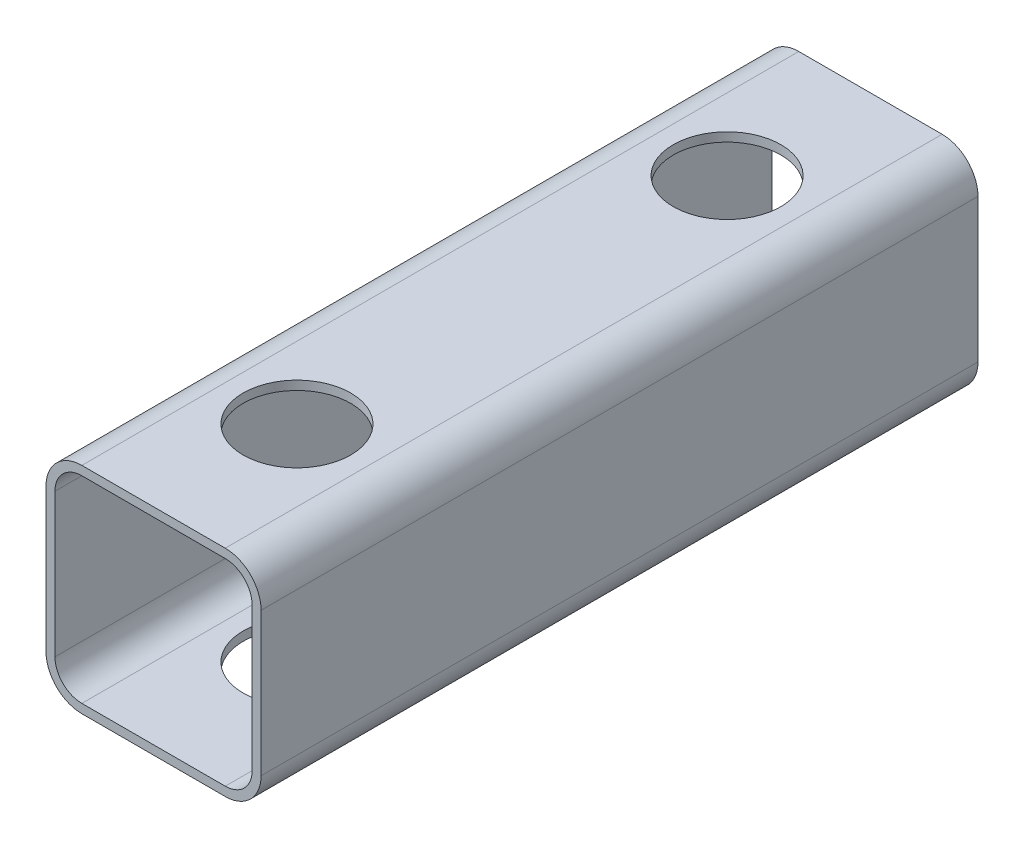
ISO-10303-21;
HEADER;
FILE_DESCRIPTION(('STEP AP214'),'2;1');
FILE_NAME('part.step','',(''),(''),'','','');
FILE_SCHEMA(('AUTOMOTIVE_DESIGN { 1 0 10303 214 1 1 1 1 }'));
ENDSEC;
DATA;
#1=APPLICATION_CONTEXT('core data for automotive mechanical design processes');
#2=APPLICATION_PROTOCOL_DEFINITION('international standard','automotive_design',2000,#1);
#3=PRODUCT_CONTEXT('',#1,'mechanical');
#4=PRODUCT('Part','Part','',(#3));
#5=PRODUCT_RELATED_PRODUCT_CATEGORY('part','',(#4));
#6=PRODUCT_DEFINITION_FORMATION('','',#4);
#7=PRODUCT_DEFINITION_CONTEXT('part definition',#1,'design');
#8=PRODUCT_DEFINITION('design','',#6,#7);
#9=PRODUCT_DEFINITION_SHAPE('','',#8);
#10=(LENGTH_UNIT() NAMED_UNIT(*) SI_UNIT(.MILLI.,.METRE.));
#11=(NAMED_UNIT(*) PLANE_ANGLE_UNIT() SI_UNIT($,.RADIAN.));
#12=(NAMED_UNIT(*) SI_UNIT($,.STERADIAN.) SOLID_ANGLE_UNIT());
#13=UNCERTAINTY_MEASURE_WITH_UNIT(LENGTH_MEASURE(1.E-05),#10,'distance_accuracy_value','');
#14=(GEOMETRIC_REPRESENTATION_CONTEXT(3) GLOBAL_UNCERTAINTY_ASSIGNED_CONTEXT((#13)) GLOBAL_UNIT_ASSIGNED_CONTEXT((#10,
#11,#12)) REPRESENTATION_CONTEXT('',''));
#15=CARTESIAN_POINT('',(0.,0.,0.));
#16=DIRECTION('',(0.,0.,1.));
#17=DIRECTION('',(1.,0.,0.));
#18=AXIS2_PLACEMENT_3D('',#15,#16,#17);
#19=CARTESIAN_POINT('',(-25.4,38.1,254.));
#20=DIRECTION('',(0.,1.,0.));
#21=DIRECTION('',(-1.,0.,0.));
#22=AXIS2_PLACEMENT_3D('',#19,#20,#21);
#23=PLANE('',#22);
#24=DIRECTION('',(1.,0.,0.));
#25=VECTOR('',#24,1.);
#26=CARTESIAN_POINT('',(-25.4,38.1,0.));
#27=LINE('',#26,#25);
#28=CARTESIAN_POINT('',(-25.4,38.1,0.));
#29=VERTEX_POINT('',#28);
#30=CARTESIAN_POINT('',(25.4,38.1,0.));
#31=VERTEX_POINT('',#30);
#32=EDGE_CURVE('E243',#29,#31,#27,.T.);
#33=ORIENTED_EDGE('',*,*,#32,.F.);
#34=DIRECTION('',(0.,0.,-1.));
#35=VECTOR('',#34,1.);
#36=CARTESIAN_POINT('',(-25.4,38.1,254.));
#37=LINE('',#36,#35);
#38=CARTESIAN_POINT('',(-25.4,38.1,254.));
#39=VERTEX_POINT('',#38);
#40=EDGE_CURVE('E41',#39,#29,#37,.T.);
#41=ORIENTED_EDGE('',*,*,#40,.F.);
#42=DIRECTION('',(1.,0.,0.));
#43=VECTOR('',#42,1.);
#44=CARTESIAN_POINT('',(-25.4,38.1,254.));
#45=LINE('',#44,#43);
#46=CARTESIAN_POINT('',(25.4,38.1,254.));
#47=VERTEX_POINT('',#46);
#48=EDGE_CURVE('E220',#39,#47,#45,.T.);
#49=ORIENTED_EDGE('',*,*,#48,.T.);
#50=DIRECTION('',(0.,0.,-1.));
#51=VECTOR('',#50,1.);
#52=CARTESIAN_POINT('',(25.4,38.1,254.));
#53=LINE('',#52,#51);
#54=EDGE_CURVE('E11',#47,#31,#53,.T.);
#55=ORIENTED_EDGE('',*,*,#54,.T.);
#56=EDGE_LOOP('',(#33,#41,#49,#55));
#57=FACE_BOUND('',#56,.T.);
#58=CARTESIAN_POINT('',(0.,38.1,50.8));
#59=DIRECTION('',(0.,1.,0.));
#60=DIRECTION('',(-1.,0.,0.));
#61=AXIS2_PLACEMENT_3D('',#58,#59,#60);
#62=CIRCLE('',#61,19.05);
#63=CARTESIAN_POINT('',(-19.05,38.1,50.8));
#64=VERTEX_POINT('',#63);
#65=EDGE_CURVE('E281',#64,#64,#62,.T.);
#66=ORIENTED_EDGE('',*,*,#65,.F.);
#67=EDGE_LOOP('',(#66));
#68=FACE_BOUND('',#67,.T.);
#69=CARTESIAN_POINT('',(0.,38.1,203.2));
#70=DIRECTION('',(0.,-1.,0.));
#71=DIRECTION('',(1.,0.,0.));
#72=AXIS2_PLACEMENT_3D('',#69,#70,#71);
#73=CIRCLE('',#72,19.05);
#74=CARTESIAN_POINT('',(19.05,38.1,203.2));
#75=VERTEX_POINT('',#74);
#76=EDGE_CURVE('E291',#75,#75,#73,.T.);
#77=ORIENTED_EDGE('',*,*,#76,.T.);
#78=EDGE_LOOP('',(#77));
#79=FACE_BOUND('',#78,.T.);
#80=ADVANCED_FACE('F32',(#57,#68,#79),#23,.T.);
#81=CARTESIAN_POINT('',(25.4,-38.1,254.));
#82=DIRECTION('',(0.,-1.,0.));
#83=DIRECTION('',(1.,0.,0.));
#84=AXIS2_PLACEMENT_3D('',#81,#82,#83);
#85=PLANE('',#84);
#86=DIRECTION('',(-1.,0.,0.));
#87=VECTOR('',#86,1.);
#88=CARTESIAN_POINT('',(25.4,-38.1,0.));
#89=LINE('',#88,#87);
#90=CARTESIAN_POINT('',(25.4,-38.1,0.));
#91=VERTEX_POINT('',#90);
#92=CARTESIAN_POINT('',(-25.4,-38.1,0.));
#93=VERTEX_POINT('',#92);
#94=EDGE_CURVE('E255',#91,#93,#89,.T.);
#95=ORIENTED_EDGE('',*,*,#94,.F.);
#96=DIRECTION('',(0.,0.,-1.));
#97=VECTOR('',#96,1.);
#98=CARTESIAN_POINT('',(25.4,-38.1,254.));
#99=LINE('',#98,#97);
#100=CARTESIAN_POINT('',(25.4,-38.1,254.));
#101=VERTEX_POINT('',#100);
#102=EDGE_CURVE('E266',#101,#91,#99,.T.);
#103=ORIENTED_EDGE('',*,*,#102,.F.);
#104=DIRECTION('',(-1.,0.,0.));
#105=VECTOR('',#104,1.);
#106=CARTESIAN_POINT('',(25.4,-38.1,254.));
#107=LINE('',#106,#105);
#108=CARTESIAN_POINT('',(-25.4,-38.1,254.));
#109=VERTEX_POINT('',#108);
#110=EDGE_CURVE('E232',#101,#109,#107,.T.);
#111=ORIENTED_EDGE('',*,*,#110,.T.);
#112=DIRECTION('',(0.,0.,-1.));
#113=VECTOR('',#112,1.);
#114=CARTESIAN_POINT('',(-25.4,-38.1,254.));
#115=LINE('',#114,#113);
#116=EDGE_CURVE('E268',#109,#93,#115,.T.);
#117=ORIENTED_EDGE('',*,*,#116,.T.);
#118=EDGE_LOOP('',(#95,#103,#111,#117));
#119=FACE_BOUND('',#118,.T.);
#120=CARTESIAN_POINT('',(0.,-38.1,50.8));
#121=DIRECTION('',(0.,1.,0.));
#122=DIRECTION('',(-1.,0.,0.));
#123=AXIS2_PLACEMENT_3D('',#120,#121,#122);
#124=CIRCLE('',#123,19.05);
#125=CARTESIAN_POINT('',(-19.05,-38.1,50.8));
#126=VERTEX_POINT('',#125);
#127=EDGE_CURVE('E276',#126,#126,#124,.T.);
#128=ORIENTED_EDGE('',*,*,#127,.T.);
#129=EDGE_LOOP('',(#128));
#130=FACE_BOUND('',#129,.T.);
#131=CARTESIAN_POINT('',(0.,-38.1,203.2));
#132=DIRECTION('',(0.,-1.,0.));
#133=DIRECTION('',(1.,0.,0.));
#134=AXIS2_PLACEMENT_3D('',#131,#132,#133);
#135=CIRCLE('',#134,19.05);
#136=CARTESIAN_POINT('',(19.05,-38.1,203.2));
#137=VERTEX_POINT('',#136);
#138=EDGE_CURVE('E294',#137,#137,#135,.T.);
#139=ORIENTED_EDGE('',*,*,#138,.F.);
#140=EDGE_LOOP('',(#139));
#141=FACE_BOUND('',#140,.T.);
#142=ADVANCED_FACE('F314',(#119,#130,#141),#85,.T.);
#143=CARTESIAN_POINT('',(-25.4,34.925,254.));
#144=DIRECTION('',(0.,1.,0.));
#145=DIRECTION('',(-1.,0.,0.));
#146=AXIS2_PLACEMENT_3D('',#143,#144,#145);
#147=PLANE('',#146);
#148=DIRECTION('',(1.,0.,0.));
#149=VECTOR('',#148,1.);
#150=CARTESIAN_POINT('',(-25.4,34.925,0.));
#151=LINE('',#150,#149);
#152=CARTESIAN_POINT('',(-25.4,34.925,0.));
#153=VERTEX_POINT('',#152);
#154=CARTESIAN_POINT('',(25.4,34.925,0.));
#155=VERTEX_POINT('',#154);
#156=EDGE_CURVE('E163',#153,#155,#151,.T.);
#157=ORIENTED_EDGE('',*,*,#156,.T.);
#158=DIRECTION('',(0.,0.,-1.));
#159=VECTOR('',#158,1.);
#160=CARTESIAN_POINT('',(25.4,34.925,254.));
#161=LINE('',#160,#159);
#162=CARTESIAN_POINT('',(25.4,34.925,254.));
#163=VERTEX_POINT('',#162);
#164=EDGE_CURVE('E148',#163,#155,#161,.T.);
#165=ORIENTED_EDGE('',*,*,#164,.F.);
#166=DIRECTION('',(1.,0.,0.));
#167=VECTOR('',#166,1.);
#168=CARTESIAN_POINT('',(-25.4,34.925,254.));
#169=LINE('',#168,#167);
#170=CARTESIAN_POINT('',(-25.4,34.925,254.));
#171=VERTEX_POINT('',#170);
#172=EDGE_CURVE('E154',#171,#163,#169,.T.);
#173=ORIENTED_EDGE('',*,*,#172,.F.);
#174=DIRECTION('',(0.,0.,-1.));
#175=VECTOR('',#174,1.);
#176=CARTESIAN_POINT('',(-25.4,34.925,254.));
#177=LINE('',#176,#175);
#178=EDGE_CURVE('E165',#171,#153,#177,.T.);
#179=ORIENTED_EDGE('',*,*,#178,.T.);
#180=EDGE_LOOP('',(#157,#165,#173,#179));
#181=FACE_BOUND('',#180,.T.);
#182=CARTESIAN_POINT('',(0.,34.925,50.8));
#183=DIRECTION('',(0.,1.,0.));
#184=DIRECTION('',(-1.,0.,0.));
#185=AXIS2_PLACEMENT_3D('',#182,#183,#184);
#186=CIRCLE('',#185,19.05);
#187=CARTESIAN_POINT('',(-19.05,34.925,50.8));
#188=VERTEX_POINT('',#187);
#189=EDGE_CURVE('E187',#188,#188,#186,.T.);
#190=ORIENTED_EDGE('',*,*,#189,.T.);
#191=EDGE_LOOP('',(#190));
#192=FACE_BOUND('',#191,.T.);
#193=CARTESIAN_POINT('',(0.,34.925,203.2));
#194=DIRECTION('',(0.,1.,0.));
#195=DIRECTION('',(-1.,0.,0.));
#196=AXIS2_PLACEMENT_3D('',#193,#194,#195);
#197=CIRCLE('',#196,19.05);
#198=CARTESIAN_POINT('',(-19.05,34.925,203.2));
#199=VERTEX_POINT('',#198);
#200=EDGE_CURVE('E286',#199,#199,#197,.F.);
#201=ORIENTED_EDGE('',*,*,#200,.F.);
#202=EDGE_LOOP('',(#201));
#203=FACE_BOUND('',#202,.T.);
#204=ADVANCED_FACE('F159',(#181,#192,#203),#147,.F.);
#205=CARTESIAN_POINT('',(25.4,-34.925,254.));
#206=DIRECTION('',(0.,-1.,0.));
#207=DIRECTION('',(1.,0.,0.));
#208=AXIS2_PLACEMENT_3D('',#205,#206,#207);
#209=PLANE('',#208);
#210=DIRECTION('',(-1.,0.,0.));
#211=VECTOR('',#210,1.);
#212=CARTESIAN_POINT('',(25.4,-34.925,0.));
#213=LINE('',#212,#211);
#214=CARTESIAN_POINT('',(25.4,-34.925,0.));
#215=VERTEX_POINT('',#214);
#216=CARTESIAN_POINT('',(-25.4,-34.925,0.));
#217=VERTEX_POINT('',#216);
#218=EDGE_CURVE('E198',#215,#217,#213,.T.);
#219=ORIENTED_EDGE('',*,*,#218,.T.);
#220=DIRECTION('',(0.,0.,-1.));
#221=VECTOR('',#220,1.);
#222=CARTESIAN_POINT('',(-25.4,-34.925,254.));
#223=LINE('',#222,#221);
#224=CARTESIAN_POINT('',(-25.4,-34.925,254.));
#225=VERTEX_POINT('',#224);
#226=EDGE_CURVE('E211',#225,#217,#223,.T.);
#227=ORIENTED_EDGE('',*,*,#226,.F.);
#228=DIRECTION('',(-1.,0.,0.));
#229=VECTOR('',#228,1.);
#230=CARTESIAN_POINT('',(25.4,-34.925,254.));
#231=LINE('',#230,#229);
#232=CARTESIAN_POINT('',(25.4,-34.925,254.));
#233=VERTEX_POINT('',#232);
#234=EDGE_CURVE('E180',#233,#225,#231,.T.);
#235=ORIENTED_EDGE('',*,*,#234,.F.);
#236=DIRECTION('',(0.,0.,-1.));
#237=VECTOR('',#236,1.);
#238=CARTESIAN_POINT('',(25.4,-34.925,254.));
#239=LINE('',#238,#237);
#240=EDGE_CURVE('E209',#233,#215,#239,.T.);
#241=ORIENTED_EDGE('',*,*,#240,.T.);
#242=EDGE_LOOP('',(#219,#227,#235,#241));
#243=FACE_BOUND('',#242,.T.);
#244=CARTESIAN_POINT('',(0.,-34.925,50.8));
#245=DIRECTION('',(0.,-1.,0.));
#246=DIRECTION('',(1.,0.,0.));
#247=AXIS2_PLACEMENT_3D('',#244,#245,#246);
#248=CIRCLE('',#247,19.05);
#249=CARTESIAN_POINT('',(19.05,-34.925,50.8));
#250=VERTEX_POINT('',#249);
#251=EDGE_CURVE('E274',#250,#250,#248,.T.);
#252=ORIENTED_EDGE('',*,*,#251,.T.);
#253=EDGE_LOOP('',(#252));
#254=FACE_BOUND('',#253,.T.);
#255=CARTESIAN_POINT('',(0.,-34.925,203.2));
#256=DIRECTION('',(0.,-1.,0.));
#257=DIRECTION('',(1.,0.,0.));
#258=AXIS2_PLACEMENT_3D('',#255,#256,#257);
#259=CIRCLE('',#258,19.05);
#260=CARTESIAN_POINT('',(19.05,-34.925,203.2));
#261=VERTEX_POINT('',#260);
#262=EDGE_CURVE('E36',#261,#261,#259,.F.);
#263=ORIENTED_EDGE('',*,*,#262,.F.);
#264=EDGE_LOOP('',(#263));
#265=FACE_BOUND('',#264,.T.);
#266=ADVANCED_FACE('F303',(#243,#254,#265),#209,.F.);
#267=CARTESIAN_POINT('',(25.4,25.4,254.));
#268=DIRECTION('',(0.,0.,1.));
#269=DIRECTION('',(1.,0.,0.));
#270=AXIS2_PLACEMENT_3D('',#267,#268,#269);
#271=PLANE('',#270);
#272=CARTESIAN_POINT('',(25.4,25.4,254.));
#273=DIRECTION('',(0.,0.,1.));
#274=DIRECTION('',(1.,0.,0.));
#275=AXIS2_PLACEMENT_3D('',#272,#273,#274);
#276=CIRCLE('',#275,12.7);
#277=CARTESIAN_POINT('',(38.1,25.4,254.));
#278=VERTEX_POINT('',#277);
#279=EDGE_CURVE('E218',#278,#47,#276,.T.);
#280=ORIENTED_EDGE('',*,*,#279,.T.);
#281=ORIENTED_EDGE('',*,*,#48,.F.);
#282=CARTESIAN_POINT('',(-25.4,25.4,254.));
#283=DIRECTION('',(0.,0.,-1.));
#284=DIRECTION('',(-1.,0.,0.));
#285=AXIS2_PLACEMENT_3D('',#282,#283,#284);
#286=CIRCLE('',#285,12.7);
#287=CARTESIAN_POINT('',(-38.1,25.4,254.));
#288=VERTEX_POINT('',#287);
#289=EDGE_CURVE('E224',#288,#39,#286,.T.);
#290=ORIENTED_EDGE('',*,*,#289,.F.);
#291=DIRECTION('',(0.,-1.,0.));
#292=VECTOR('',#291,1.);
#293=CARTESIAN_POINT('',(-38.1,25.4,254.));
#294=LINE('',#293,#292);
#295=CARTESIAN_POINT('',(-38.1,-25.4,254.));
#296=VERTEX_POINT('',#295);
#297=EDGE_CURVE('E227',#288,#296,#294,.T.);
#298=ORIENTED_EDGE('',*,*,#297,.T.);
#299=CARTESIAN_POINT('',(-25.4,-25.4,254.));
#300=DIRECTION('',(0.,0.,-1.));
#301=DIRECTION('',(-1.,0.,0.));
#302=AXIS2_PLACEMENT_3D('',#299,#300,#301);
#303=CIRCLE('',#302,12.7);
#304=EDGE_CURVE('E229',#109,#296,#303,.T.);
#305=ORIENTED_EDGE('',*,*,#304,.F.);
#306=ORIENTED_EDGE('',*,*,#110,.F.);
#307=CARTESIAN_POINT('',(25.4,-25.4,254.));
#308=DIRECTION('',(0.,0.,-1.));
#309=DIRECTION('',(-1.,0.,0.));
#310=AXIS2_PLACEMENT_3D('',#307,#308,#309);
#311=CIRCLE('',#310,12.7);
#312=CARTESIAN_POINT('',(38.1,-25.4000000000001,254.));
#313=VERTEX_POINT('',#312);
#314=EDGE_CURVE('E235',#313,#101,#311,.T.);
#315=ORIENTED_EDGE('',*,*,#314,.F.);
#316=DIRECTION('',(0.,1.,0.));
#317=VECTOR('',#316,1.);
#318=CARTESIAN_POINT('',(38.1,-25.4000000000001,254.));
#319=LINE('',#318,#317);
#320=EDGE_CURVE('E238',#313,#278,#319,.T.);
#321=ORIENTED_EDGE('',*,*,#320,.T.);
#322=EDGE_LOOP('',(#280,#281,#290,#298,#305,#306,#315,#321));
#323=FACE_BOUND('',#322,.T.);
#324=ORIENTED_EDGE('',*,*,#172,.T.);
#325=CARTESIAN_POINT('',(25.4,25.4,254.));
#326=DIRECTION('',(0.,0.,1.));
#327=DIRECTION('',(1.,0.,0.));
#328=AXIS2_PLACEMENT_3D('',#325,#326,#327);
#329=CIRCLE('',#328,9.525);
#330=CARTESIAN_POINT('',(34.925,25.4,254.));
#331=VERTEX_POINT('',#330);
#332=EDGE_CURVE('E145',#331,#163,#329,.T.);
#333=ORIENTED_EDGE('',*,*,#332,.F.);
#334=DIRECTION('',(0.,1.,0.));
#335=VECTOR('',#334,1.);
#336=CARTESIAN_POINT('',(34.925,-25.4000000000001,254.));
#337=LINE('',#336,#335);
#338=CARTESIAN_POINT('',(34.925,-25.4000000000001,254.));
#339=VERTEX_POINT('',#338);
#340=EDGE_CURVE('E184',#339,#331,#337,.T.);
#341=ORIENTED_EDGE('',*,*,#340,.F.);
#342=CARTESIAN_POINT('',(25.4,-25.4,254.));
#343=DIRECTION('',(0.,0.,1.));
#344=DIRECTION('',(1.,0.,0.));
#345=AXIS2_PLACEMENT_3D('',#342,#343,#344);
#346=CIRCLE('',#345,9.525);
#347=EDGE_CURVE('E49',#339,#233,#346,.F.);
#348=ORIENTED_EDGE('',*,*,#347,.T.);
#349=ORIENTED_EDGE('',*,*,#234,.T.);
#350=CARTESIAN_POINT('',(-25.4,-25.4,254.));
#351=DIRECTION('',(0.,0.,1.));
#352=DIRECTION('',(1.,0.,0.));
#353=AXIS2_PLACEMENT_3D('',#350,#351,#352);
#354=CIRCLE('',#353,9.52499999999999);
#355=CARTESIAN_POINT('',(-34.925,-25.4,254.));
#356=VERTEX_POINT('',#355);
#357=EDGE_CURVE('E177',#225,#356,#354,.F.);
#358=ORIENTED_EDGE('',*,*,#357,.T.);
#359=DIRECTION('',(0.,-1.,0.));
#360=VECTOR('',#359,1.);
#361=CARTESIAN_POINT('',(-34.925,25.4,254.));
#362=LINE('',#361,#360);
#363=CARTESIAN_POINT('',(-34.925,25.4,254.));
#364=VERTEX_POINT('',#363);
#365=EDGE_CURVE('E172',#364,#356,#362,.T.);
#366=ORIENTED_EDGE('',*,*,#365,.F.);
#367=CARTESIAN_POINT('',(-25.4,25.4,254.));
#368=DIRECTION('',(0.,0.,1.));
#369=DIRECTION('',(1.,0.,0.));
#370=AXIS2_PLACEMENT_3D('',#367,#368,#369);
#371=CIRCLE('',#370,9.525);
#372=EDGE_CURVE('E170',#364,#171,#371,.F.);
#373=ORIENTED_EDGE('',*,*,#372,.T.);
#374=EDGE_LOOP('',(#324,#333,#341,#348,#349,#358,#366,#373));
#375=FACE_BOUND('',#374,.T.);
#376=ADVANCED_FACE('F167',(#323,#375),#271,.T.);
#377=CARTESIAN_POINT('',(25.4,25.4,0.));
#378=DIRECTION('',(0.,0.,1.));
#379=DIRECTION('',(1.,0.,0.));
#380=AXIS2_PLACEMENT_3D('',#377,#378,#379);
#381=PLANE('',#380);
#382=CARTESIAN_POINT('',(25.4,25.4,0.));
#383=DIRECTION('',(0.,0.,1.));
#384=DIRECTION('',(1.,0.,0.));
#385=AXIS2_PLACEMENT_3D('',#382,#383,#384);
#386=CIRCLE('',#385,12.7);
#387=CARTESIAN_POINT('',(38.1,25.4,0.));
#388=VERTEX_POINT('',#387);
#389=EDGE_CURVE('E164',#388,#31,#386,.T.);
#390=ORIENTED_EDGE('',*,*,#389,.F.);
#391=DIRECTION('',(0.,1.,0.));
#392=VECTOR('',#391,1.);
#393=CARTESIAN_POINT('',(38.1,-25.4000000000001,0.));
#394=LINE('',#393,#392);
#395=CARTESIAN_POINT('',(38.1,-25.4000000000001,0.));
#396=VERTEX_POINT('',#395);
#397=EDGE_CURVE('E221',#396,#388,#394,.T.);
#398=ORIENTED_EDGE('',*,*,#397,.F.);
#399=CARTESIAN_POINT('',(25.4,-25.4,0.));
#400=DIRECTION('',(0.,0.,-1.));
#401=DIRECTION('',(-1.,0.,0.));
#402=AXIS2_PLACEMENT_3D('',#399,#400,#401);
#403=CIRCLE('',#402,12.7);
#404=EDGE_CURVE('E258',#396,#91,#403,.T.);
#405=ORIENTED_EDGE('',*,*,#404,.T.);
#406=ORIENTED_EDGE('',*,*,#94,.T.);
#407=CARTESIAN_POINT('',(-25.4,-25.4,0.));
#408=DIRECTION('',(0.,0.,-1.));
#409=DIRECTION('',(-1.,0.,0.));
#410=AXIS2_PLACEMENT_3D('',#407,#408,#409);
#411=CIRCLE('',#410,12.7);
#412=CARTESIAN_POINT('',(-38.1,-25.4,0.));
#413=VERTEX_POINT('',#412);
#414=EDGE_CURVE('E252',#93,#413,#411,.T.);
#415=ORIENTED_EDGE('',*,*,#414,.T.);
#416=DIRECTION('',(0.,-1.,0.));
#417=VECTOR('',#416,1.);
#418=CARTESIAN_POINT('',(-38.1,25.4,0.));
#419=LINE('',#418,#417);
#420=CARTESIAN_POINT('',(-38.1,25.4,0.));
#421=VERTEX_POINT('',#420);
#422=EDGE_CURVE('E249',#421,#413,#419,.T.);
#423=ORIENTED_EDGE('',*,*,#422,.F.);
#424=CARTESIAN_POINT('',(-25.4,25.4,0.));
#425=DIRECTION('',(0.,0.,-1.));
#426=DIRECTION('',(-1.,0.,0.));
#427=AXIS2_PLACEMENT_3D('',#424,#425,#426);
#428=CIRCLE('',#427,12.7);
#429=EDGE_CURVE('E246',#421,#29,#428,.T.);
#430=ORIENTED_EDGE('',*,*,#429,.T.);
#431=ORIENTED_EDGE('',*,*,#32,.T.);
#432=EDGE_LOOP('',(#390,#398,#405,#406,#415,#423,#430,#431));
#433=FACE_BOUND('',#432,.T.);
#434=CARTESIAN_POINT('',(25.4,25.4,0.));
#435=DIRECTION('',(0.,0.,1.));
#436=DIRECTION('',(1.,0.,0.));
#437=AXIS2_PLACEMENT_3D('',#434,#435,#436);
#438=CIRCLE('',#437,9.525);
#439=CARTESIAN_POINT('',(34.925,25.4,0.));
#440=VERTEX_POINT('',#439);
#441=EDGE_CURVE('E57',#440,#155,#438,.T.);
#442=ORIENTED_EDGE('',*,*,#441,.T.);
#443=ORIENTED_EDGE('',*,*,#156,.F.);
#444=CARTESIAN_POINT('',(-25.4,25.4,0.));
#445=DIRECTION('',(0.,0.,1.));
#446=DIRECTION('',(1.,0.,0.));
#447=AXIS2_PLACEMENT_3D('',#444,#445,#446);
#448=CIRCLE('',#447,9.525);
#449=CARTESIAN_POINT('',(-34.925,25.4,0.));
#450=VERTEX_POINT('',#449);
#451=EDGE_CURVE('E189',#450,#153,#448,.F.);
#452=ORIENTED_EDGE('',*,*,#451,.F.);
#453=DIRECTION('',(0.,-1.,0.));
#454=VECTOR('',#453,1.);
#455=CARTESIAN_POINT('',(-34.925,25.4,0.));
#456=LINE('',#455,#454);
#457=CARTESIAN_POINT('',(-34.925,-25.4,0.));
#458=VERTEX_POINT('',#457);
#459=EDGE_CURVE('E192',#450,#458,#456,.T.);
#460=ORIENTED_EDGE('',*,*,#459,.T.);
#461=CARTESIAN_POINT('',(-25.4,-25.4,0.));
#462=DIRECTION('',(0.,0.,1.));
#463=DIRECTION('',(1.,0.,0.));
#464=AXIS2_PLACEMENT_3D('',#461,#462,#463);
#465=CIRCLE('',#464,9.52499999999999);
#466=EDGE_CURVE('E195',#217,#458,#465,.F.);
#467=ORIENTED_EDGE('',*,*,#466,.F.);
#468=ORIENTED_EDGE('',*,*,#218,.F.);
#469=CARTESIAN_POINT('',(25.4,-25.4,0.));
#470=DIRECTION('',(0.,0.,1.));
#471=DIRECTION('',(1.,0.,0.));
#472=AXIS2_PLACEMENT_3D('',#469,#470,#471);
#473=CIRCLE('',#472,9.525);
#474=CARTESIAN_POINT('',(34.925,-25.4000000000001,0.));
#475=VERTEX_POINT('',#474);
#476=EDGE_CURVE('E201',#475,#215,#473,.F.);
#477=ORIENTED_EDGE('',*,*,#476,.F.);
#478=DIRECTION('',(0.,1.,0.));
#479=VECTOR('',#478,1.);
#480=CARTESIAN_POINT('',(34.925,-25.4000000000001,0.));
#481=LINE('',#480,#479);
#482=EDGE_CURVE('E155',#475,#440,#481,.T.);
#483=ORIENTED_EDGE('',*,*,#482,.T.);
#484=EDGE_LOOP('',(#442,#443,#452,#460,#467,#468,#477,#483));
#485=FACE_BOUND('',#484,.T.);
#486=ADVANCED_FACE('F311',(#433,#485),#381,.F.);
#487=CARTESIAN_POINT('',(25.4,25.4,254.));
#488=DIRECTION('',(0.,0.,-1.));
#489=DIRECTION('',(-1.,0.,0.));
#490=AXIS2_PLACEMENT_3D('',#487,#488,#489);
#491=CYLINDRICAL_SURFACE('',#490,12.7);
#492=ORIENTED_EDGE('',*,*,#389,.T.);
#493=ORIENTED_EDGE('',*,*,#54,.F.);
#494=ORIENTED_EDGE('',*,*,#279,.F.);
#495=DIRECTION('',(0.,0.,-1.));
#496=VECTOR('',#495,1.);
#497=CARTESIAN_POINT('',(38.1,25.4,254.));
#498=LINE('',#497,#496);
#499=EDGE_CURVE('E240',#278,#388,#498,.T.);
#500=ORIENTED_EDGE('',*,*,#499,.T.);
#501=EDGE_LOOP('',(#492,#493,#494,#500));
#502=FACE_BOUND('',#501,.T.);
#503=ADVANCED_FACE('F34',(#502),#491,.T.);
#504=CARTESIAN_POINT('',(-25.4,25.4,254.));
#505=DIRECTION('',(0.,0.,-1.));
#506=DIRECTION('',(-1.,0.,0.));
#507=AXIS2_PLACEMENT_3D('',#504,#505,#506);
#508=CYLINDRICAL_SURFACE('',#507,12.7);
#509=ORIENTED_EDGE('',*,*,#429,.F.);
#510=DIRECTION('',(0.,0.,-1.));
#511=VECTOR('',#510,1.);
#512=CARTESIAN_POINT('',(-38.1,25.4,254.));
#513=LINE('',#512,#511);
#514=EDGE_CURVE('E272',#288,#421,#513,.T.);
#515=ORIENTED_EDGE('',*,*,#514,.F.);
#516=ORIENTED_EDGE('',*,*,#289,.T.);
#517=ORIENTED_EDGE('',*,*,#40,.T.);
#518=EDGE_LOOP('',(#509,#515,#516,#517));
#519=FACE_BOUND('',#518,.T.);
#520=ADVANCED_FACE('F328',(#519),#508,.T.);
#521=CARTESIAN_POINT('',(-38.1,25.4,254.));
#522=DIRECTION('',(1.,0.,0.));
#523=DIRECTION('',(0.,1.,0.));
#524=AXIS2_PLACEMENT_3D('',#521,#522,#523);
#525=PLANE('',#524);
#526=ORIENTED_EDGE('',*,*,#422,.T.);
#527=DIRECTION('',(0.,0.,-1.));
#528=VECTOR('',#527,1.);
#529=CARTESIAN_POINT('',(-38.1,-25.4,254.));
#530=LINE('',#529,#528);
#531=EDGE_CURVE('E270',#296,#413,#530,.T.);
#532=ORIENTED_EDGE('',*,*,#531,.F.);
#533=ORIENTED_EDGE('',*,*,#297,.F.);
#534=ORIENTED_EDGE('',*,*,#514,.T.);
#535=EDGE_LOOP('',(#526,#532,#533,#534));
#536=FACE_BOUND('',#535,.T.);
#537=ADVANCED_FACE('F331',(#536),#525,.F.);
#538=CARTESIAN_POINT('',(-25.4,-25.4,254.));
#539=DIRECTION('',(0.,0.,-1.));
#540=DIRECTION('',(-1.,0.,0.));
#541=AXIS2_PLACEMENT_3D('',#538,#539,#540);
#542=CYLINDRICAL_SURFACE('',#541,12.7);
#543=ORIENTED_EDGE('',*,*,#414,.F.);
#544=ORIENTED_EDGE('',*,*,#116,.F.);
#545=ORIENTED_EDGE('',*,*,#304,.T.);
#546=ORIENTED_EDGE('',*,*,#531,.T.);
#547=EDGE_LOOP('',(#543,#544,#545,#546));
#548=FACE_BOUND('',#547,.T.);
#549=ADVANCED_FACE('F335',(#548),#542,.T.);
#550=CARTESIAN_POINT('',(25.4,-25.4,254.));
#551=DIRECTION('',(0.,0.,-1.));
#552=DIRECTION('',(-1.,0.,0.));
#553=AXIS2_PLACEMENT_3D('',#550,#551,#552);
#554=CYLINDRICAL_SURFACE('',#553,12.7);
#555=ORIENTED_EDGE('',*,*,#404,.F.);
#556=DIRECTION('',(0.,0.,-1.));
#557=VECTOR('',#556,1.);
#558=CARTESIAN_POINT('',(38.1,-25.4000000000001,254.));
#559=LINE('',#558,#557);
#560=EDGE_CURVE('E264',#313,#396,#559,.T.);
#561=ORIENTED_EDGE('',*,*,#560,.F.);
#562=ORIENTED_EDGE('',*,*,#314,.T.);
#563=ORIENTED_EDGE('',*,*,#102,.T.);
#564=EDGE_LOOP('',(#555,#561,#562,#563));
#565=FACE_BOUND('',#564,.T.);
#566=ADVANCED_FACE('F338',(#565),#554,.T.);
#567=CARTESIAN_POINT('',(38.1,-25.4000000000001,254.));
#568=DIRECTION('',(-1.,0.,0.));
#569=DIRECTION('',(0.,-1.,0.));
#570=AXIS2_PLACEMENT_3D('',#567,#568,#569);
#571=PLANE('',#570);
#572=ORIENTED_EDGE('',*,*,#397,.T.);
#573=ORIENTED_EDGE('',*,*,#499,.F.);
#574=ORIENTED_EDGE('',*,*,#320,.F.);
#575=ORIENTED_EDGE('',*,*,#560,.T.);
#576=EDGE_LOOP('',(#572,#573,#574,#575));
#577=FACE_BOUND('',#576,.T.);
#578=ADVANCED_FACE('F343',(#577),#571,.F.);
#579=CARTESIAN_POINT('',(25.4,25.4,254.));
#580=DIRECTION('',(0.,0.,-1.));
#581=DIRECTION('',(-1.,0.,0.));
#582=AXIS2_PLACEMENT_3D('',#579,#580,#581);
#583=CYLINDRICAL_SURFACE('',#582,9.525);
#584=ORIENTED_EDGE('',*,*,#441,.F.);
#585=DIRECTION('',(0.,0.,-1.));
#586=VECTOR('',#585,1.);
#587=CARTESIAN_POINT('',(34.925,25.4,254.));
#588=LINE('',#587,#586);
#589=EDGE_CURVE('E150',#331,#440,#588,.T.);
#590=ORIENTED_EDGE('',*,*,#589,.F.);
#591=ORIENTED_EDGE('',*,*,#332,.T.);
#592=ORIENTED_EDGE('',*,*,#164,.T.);
#593=EDGE_LOOP('',(#584,#590,#591,#592));
#594=FACE_BOUND('',#593,.T.);
#595=ADVANCED_FACE('F147',(#594),#583,.F.);
#596=CARTESIAN_POINT('',(-25.4,25.4,254.));
#597=DIRECTION('',(0.,0.,-1.));
#598=DIRECTION('',(-1.,0.,0.));
#599=AXIS2_PLACEMENT_3D('',#596,#597,#598);
#600=CYLINDRICAL_SURFACE('',#599,9.525);
#601=ORIENTED_EDGE('',*,*,#451,.T.);
#602=ORIENTED_EDGE('',*,*,#178,.F.);
#603=ORIENTED_EDGE('',*,*,#372,.F.);
#604=DIRECTION('',(0.,0.,-1.));
#605=VECTOR('',#604,1.);
#606=CARTESIAN_POINT('',(-34.925,25.4,254.));
#607=LINE('',#606,#605);
#608=EDGE_CURVE('E215',#364,#450,#607,.T.);
#609=ORIENTED_EDGE('',*,*,#608,.T.);
#610=EDGE_LOOP('',(#601,#602,#603,#609));
#611=FACE_BOUND('',#610,.T.);
#612=ADVANCED_FACE('F352',(#611),#600,.F.);
#613=CARTESIAN_POINT('',(-34.925,25.4,254.));
#614=DIRECTION('',(1.,0.,0.));
#615=DIRECTION('',(0.,1.,0.));
#616=AXIS2_PLACEMENT_3D('',#613,#614,#615);
#617=PLANE('',#616);
#618=ORIENTED_EDGE('',*,*,#459,.F.);
#619=ORIENTED_EDGE('',*,*,#608,.F.);
#620=ORIENTED_EDGE('',*,*,#365,.T.);
#621=DIRECTION('',(0.,0.,-1.));
#622=VECTOR('',#621,1.);
#623=CARTESIAN_POINT('',(-34.925,-25.4,254.));
#624=LINE('',#623,#622);
#625=EDGE_CURVE('E213',#356,#458,#624,.T.);
#626=ORIENTED_EDGE('',*,*,#625,.T.);
#627=EDGE_LOOP('',(#618,#619,#620,#626));
#628=FACE_BOUND('',#627,.T.);
#629=ADVANCED_FACE('F356',(#628),#617,.T.);
#630=CARTESIAN_POINT('',(-25.4,-25.4,254.));
#631=DIRECTION('',(0.,0.,-1.));
#632=DIRECTION('',(-1.,0.,0.));
#633=AXIS2_PLACEMENT_3D('',#630,#631,#632);
#634=CYLINDRICAL_SURFACE('',#633,9.52499999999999);
#635=ORIENTED_EDGE('',*,*,#466,.T.);
#636=ORIENTED_EDGE('',*,*,#625,.F.);
#637=ORIENTED_EDGE('',*,*,#357,.F.);
#638=ORIENTED_EDGE('',*,*,#226,.T.);
#639=EDGE_LOOP('',(#635,#636,#637,#638));
#640=FACE_BOUND('',#639,.T.);
#641=ADVANCED_FACE('F359',(#640),#634,.F.);
#642=CARTESIAN_POINT('',(25.4,-25.4,254.));
#643=DIRECTION('',(0.,0.,-1.));
#644=DIRECTION('',(-1.,0.,0.));
#645=AXIS2_PLACEMENT_3D('',#642,#643,#644);
#646=CYLINDRICAL_SURFACE('',#645,9.525);
#647=ORIENTED_EDGE('',*,*,#476,.T.);
#648=ORIENTED_EDGE('',*,*,#240,.F.);
#649=ORIENTED_EDGE('',*,*,#347,.F.);
#650=DIRECTION('',(0.,0.,-1.));
#651=VECTOR('',#650,1.);
#652=CARTESIAN_POINT('',(34.925,-25.4000000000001,254.));
#653=LINE('',#652,#651);
#654=EDGE_CURVE('E207',#339,#475,#653,.T.);
#655=ORIENTED_EDGE('',*,*,#654,.T.);
#656=EDGE_LOOP('',(#647,#648,#649,#655));
#657=FACE_BOUND('',#656,.T.);
#658=ADVANCED_FACE('F362',(#657),#646,.F.);
#659=CARTESIAN_POINT('',(34.925,-25.4000000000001,254.));
#660=DIRECTION('',(-1.,0.,0.));
#661=DIRECTION('',(0.,-1.,0.));
#662=AXIS2_PLACEMENT_3D('',#659,#660,#661);
#663=PLANE('',#662);
#664=ORIENTED_EDGE('',*,*,#482,.F.);
#665=ORIENTED_EDGE('',*,*,#654,.F.);
#666=ORIENTED_EDGE('',*,*,#340,.T.);
#667=ORIENTED_EDGE('',*,*,#589,.T.);
#668=EDGE_LOOP('',(#664,#665,#666,#667));
#669=FACE_BOUND('',#668,.T.);
#670=ADVANCED_FACE('F367',(#669),#663,.T.);
#671=CARTESIAN_POINT('',(0.,-38.1,50.8));
#672=DIRECTION('',(0.,1.,0.));
#673=DIRECTION('',(-1.,0.,0.));
#674=AXIS2_PLACEMENT_3D('',#671,#672,#673);
#675=CYLINDRICAL_SURFACE('',#674,19.05);
#676=ORIENTED_EDGE('',*,*,#127,.F.);
#677=EDGE_LOOP('',(#676));
#678=FACE_BOUND('',#677,.T.);
#679=ORIENTED_EDGE('',*,*,#251,.F.);
#680=EDGE_LOOP('',(#679));
#681=FACE_BOUND('',#680,.T.);
#682=ADVANCED_FACE('F380',(#678,#681),#675,.F.);
#683=ORIENTED_EDGE('',*,*,#65,.T.);
#684=EDGE_LOOP('',(#683));
#685=FACE_BOUND('',#684,.T.);
#686=ORIENTED_EDGE('',*,*,#189,.F.);
#687=EDGE_LOOP('',(#686));
#688=FACE_BOUND('',#687,.T.);
#689=ADVANCED_FACE('F385',(#685,#688),#675,.F.);
#690=CARTESIAN_POINT('',(0.,-38.1,203.2));
#691=DIRECTION('',(0.,1.,0.));
#692=DIRECTION('',(-1.,0.,0.));
#693=AXIS2_PLACEMENT_3D('',#690,#691,#692);
#694=CYLINDRICAL_SURFACE('',#693,19.05);
#695=ORIENTED_EDGE('',*,*,#138,.T.);
#696=EDGE_LOOP('',(#695));
#697=FACE_BOUND('',#696,.T.);
#698=ORIENTED_EDGE('',*,*,#262,.T.);
#699=EDGE_LOOP('',(#698));
#700=FACE_BOUND('',#699,.T.);
#701=ADVANCED_FACE('F301',(#697,#700),#694,.F.);
#702=ORIENTED_EDGE('',*,*,#76,.F.);
#703=EDGE_LOOP('',(#702));
#704=FACE_BOUND('',#703,.T.);
#705=ORIENTED_EDGE('',*,*,#200,.T.);
#706=EDGE_LOOP('',(#705));
#707=FACE_BOUND('',#706,.T.);
#708=ADVANCED_FACE('F391',(#704,#707),#694,.F.);
#709=CLOSED_SHELL('',(#80,#142,#204,#266,#376,#486,#503,#520,#537,#549,#566,#578,#595,#612,#629,
#641,#658,#670,#682,#689,#701,#708));
#710=MANIFOLD_SOLID_BREP('B2',#709);
#711=ADVANCED_BREP_SHAPE_REPRESENTATION('',(#18,#710),#14);
#712=SHAPE_DEFINITION_REPRESENTATION(#9,#711);
ENDSEC;
END-ISO-10303-21;
